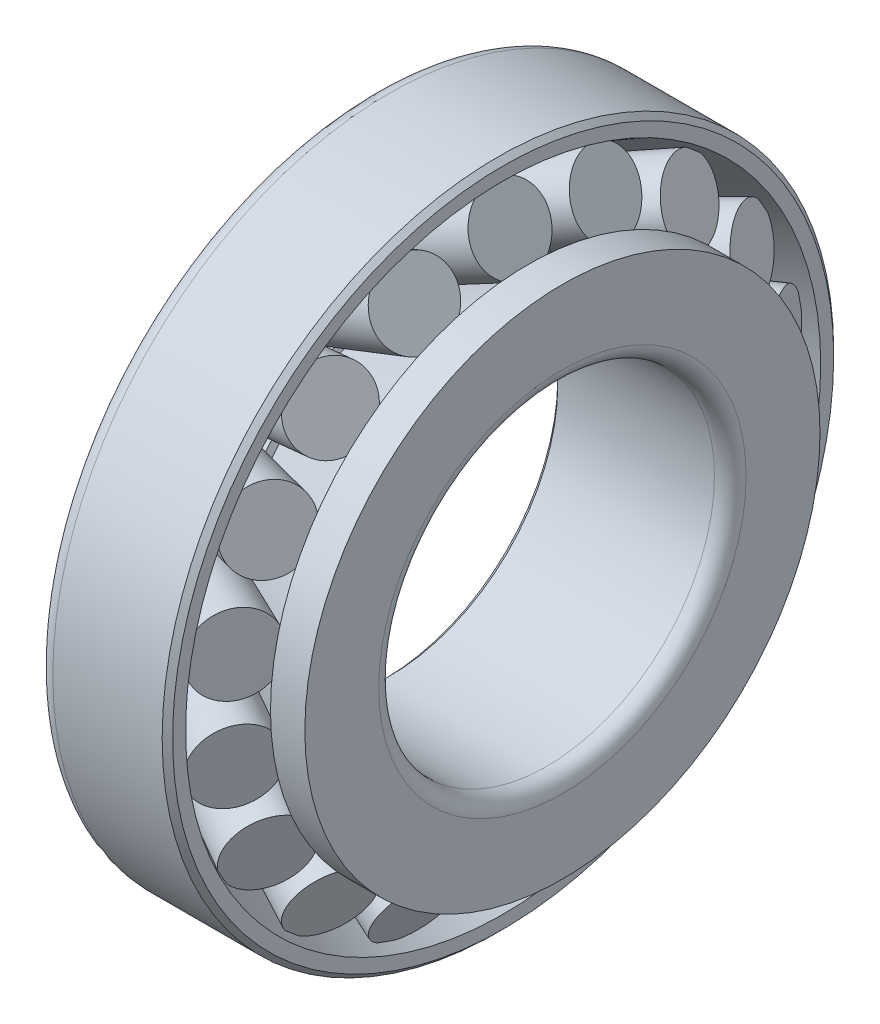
from build123d import *

# Parameters (mm, degrees)
ROLLERSDETAILED_COUNT = 18
ROLLERSDETAILED_ANGLE = 340


with BuildPart() as part:
    # OutRacSke → OuterRace (revolve)
    with BuildSketch(Plane.XY, mode=Mode.PRIVATE) as outerrace_sk:
        with BuildLine():
            Line((-15, 80.389973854), (-48, 62.814))
            Line((-48, 62.814), (-48, 81))
            ThreePointArc((-48, 81), (-46.828427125, 83.828427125), (-44, 85))
            Line((-44, 85), (-16.32, 85))
            Line((-16.32, 85), (-15, 83.68))
            Line((-15, 83.68), (-15, 80.389973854))
        make_face()
    outerrace = revolve(outerrace_sk.sketch.rotate(Axis((-42.5, 0, 0), (1, 0, 0)), 270), axis=Axis((-42.5, 0, 0), (1, 0, 0)))

    # RolDetSke → RollerDetailed (revolve)
    with BuildSketch(Plane.XY):
        Polygon((-39.475404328, 56.773929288), (-44, 65.269143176), (-17.786197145, 79.230752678), (-13.261601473, 70.73553879), align=None)
    rollerdetailed = revolve(axis=Axis((-49.062875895, 51.667591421, 0), (0.8826196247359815, 0.4700878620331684, 0)))

    # RollersDetailed: OuterRace, RollerDetailed ×18 about axis
    rollersdetailed_axis = Axis((-50, 0, 0), (1, 0, 0))
    add([outerrace.rotate(rollersdetailed_axis, i * ROLLERSDETAILED_ANGLE / (ROLLERSDETAILED_COUNT - 1)) for i in range(1, ROLLERSDETAILED_COUNT)])
    add([rollerdetailed.rotate(rollersdetailed_axis, i * ROLLERSDETAILED_ANGLE / (ROLLERSDETAILED_COUNT - 1)) for i in range(1, ROLLERSDETAILED_COUNT)])

    # InsRacSke → InnerRace (revolve)
    with BuildSketch(Plane.XY, mode=Mode.PRIVATE) as innerrace_sk:
        with BuildLine():
            Line((-35.696481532, 49.763715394), (-45, 49.763715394))
            Line((-45, 49.763715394), (-45, 43.82))
            Line((-45, 43.82), (-43.68, 42.5))
            Line((-43.68, 42.5), (-4, 42.5))
            ThreePointArc((-4, 42.5), (-1.171572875, 43.671572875), (0, 46.5))
            Line((0, 46.5), (0, 65.210324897))
            Line((0, 65.210324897), (-8.691759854, 65.210324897))
            Line((-8.691759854, 65.210324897), (-8.691759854, 62.240324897))
            Line((-8.691759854, 62.240324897), (-34.905562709, 48.278715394))
            Line((-34.905562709, 48.278715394), (-35.696481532, 49.763715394))
        make_face()
    revolve(innerrace_sk.sketch.rotate(Axis((-42.5, 0, 0), (1, 0, 0)), 270), axis=Axis((-42.5, 0, 0), (1, 0, 0)))


solid = part.part
